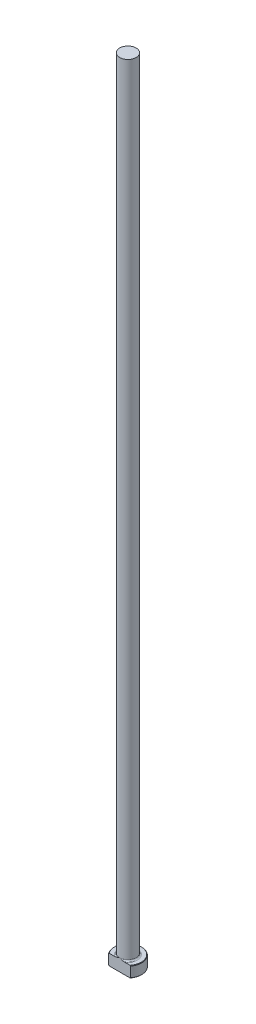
from build123d import *

# Parameters (mm, degrees)
CHAMFER1_SIZE = 0.254
FILLET1_R     = 0.762
KEY_DEPTH     = 458.337783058


with BuildPart() as part:
    # Sketch1 → Revolve1 (revolve)
    with BuildSketch(Plane.XY, mode=Mode.PRIVATE) as revolve1_sk:
        Polygon((0, 0), (-7.9375, 0), (-7.9375, 6.35), (-4.7625, 6.35), (-4.7625, 457.2), (0, 457.2), align=None)
    revolve(revolve1_sk.sketch.rotate(Axis((0, 259.958771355, 0), (0, -1, 0)), 270), axis=Axis((0, 259.958771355, 0), (0, -1, 0)))

    # Chamfer1
    chamfer1_edges = [part.edges().sort_by_distance(p)[0] for p in [
        (0, 6.35, -7.9375),
        (0, 0, -7.9375),
    ]]
    chamfer(chamfer1_edges, length=CHAMFER1_SIZE)

    # Fillet1
    fillet1_edges = [part.edges().sort_by_distance(p)[0] for p in [
        (0, 6.35, -4.7625),
    ]]
    fillet(fillet1_edges, radius=FILLET1_R)

    # Sketch2 → Key (cut, through all)
    with BuildSketch(Plane(origin=(0, 0, 0), x_dir=(1, 0, 0), z_dir=(0, 1, 0))):
        with BuildLine():
            Line((-6.35, -4.7625), (6.35, -4.7625))
            ThreePointArc((6.35, -4.7625), (0, -7.9375), (-6.35, -4.7625))
        make_face()
    extrude(amount=KEY_DEPTH, mode=Mode.SUBTRACT)


solid = part.part
